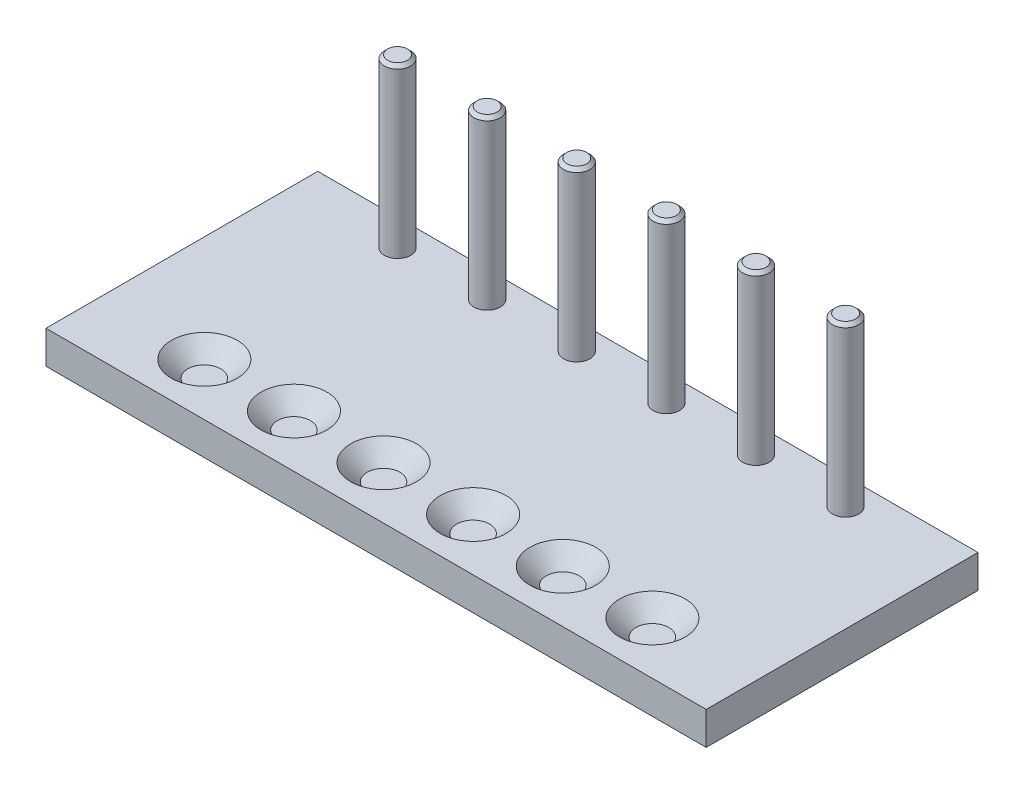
ISO-10303-21;
HEADER;
FILE_DESCRIPTION(('STEP AP214'),'2;1');
FILE_NAME('part.step','',(''),(''),'','','');
FILE_SCHEMA(('AUTOMOTIVE_DESIGN { 1 0 10303 214 1 1 1 1 }'));
ENDSEC;
DATA;
#1=APPLICATION_CONTEXT('core data for automotive mechanical design processes');
#2=APPLICATION_PROTOCOL_DEFINITION('international standard','automotive_design',2000,#1);
#3=PRODUCT_CONTEXT('',#1,'mechanical');
#4=PRODUCT('Part','Part','',(#3));
#5=PRODUCT_RELATED_PRODUCT_CATEGORY('part','',(#4));
#6=PRODUCT_DEFINITION_FORMATION('','',#4);
#7=PRODUCT_DEFINITION_CONTEXT('part definition',#1,'design');
#8=PRODUCT_DEFINITION('design','',#6,#7);
#9=PRODUCT_DEFINITION_SHAPE('','',#8);
#10=(LENGTH_UNIT() NAMED_UNIT(*) SI_UNIT(.MILLI.,.METRE.));
#11=(NAMED_UNIT(*) PLANE_ANGLE_UNIT() SI_UNIT($,.RADIAN.));
#12=(NAMED_UNIT(*) SI_UNIT($,.STERADIAN.) SOLID_ANGLE_UNIT());
#13=UNCERTAINTY_MEASURE_WITH_UNIT(LENGTH_MEASURE(1.E-05),#10,'distance_accuracy_value','');
#14=(GEOMETRIC_REPRESENTATION_CONTEXT(3) GLOBAL_UNCERTAINTY_ASSIGNED_CONTEXT((#13)) GLOBAL_UNIT_ASSIGNED_CONTEXT((#10,
#11,#12)) REPRESENTATION_CONTEXT('',''));
#15=CARTESIAN_POINT('',(0.,0.,0.));
#16=DIRECTION('',(0.,0.,1.));
#17=DIRECTION('',(1.,0.,0.));
#18=AXIS2_PLACEMENT_3D('',#15,#16,#17);
#19=CARTESIAN_POINT('',(-75.9860815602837,0.,44.0221631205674));
#20=DIRECTION('',(0.,1.,0.));
#21=DIRECTION('',(0.,0.,1.));
#22=AXIS2_PLACEMENT_3D('',#19,#20,#21);
#23=PLANE('',#22);
#24=CARTESIAN_POINT('',(-48.7718815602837,0.,28.1471631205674));
#25=DIRECTION('',(0.,1.,0.));
#26=DIRECTION('',(0.,0.,1.));
#27=AXIS2_PLACEMENT_3D('',#24,#25,#26);
#28=CIRCLE('',#27,10.);
#29=CARTESIAN_POINT('',(-48.7718815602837,0.,38.1471631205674));
#30=VERTEX_POINT('',#29);
#31=EDGE_CURVE('E160',#30,#30,#28,.F.);
#32=ORIENTED_EDGE('',*,*,#31,.T.);
#33=EDGE_LOOP('',(#32));
#34=FACE_BOUND('',#33,.T.);
#35=CARTESIAN_POINT('',(-21.5576815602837,0.,28.1471631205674));
#36=DIRECTION('',(0.,1.,0.));
#37=DIRECTION('',(0.,0.,1.));
#38=AXIS2_PLACEMENT_3D('',#35,#36,#37);
#39=CIRCLE('',#38,10.);
#40=CARTESIAN_POINT('',(-21.5576815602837,0.,38.1471631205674));
#41=VERTEX_POINT('',#40);
#42=EDGE_CURVE('E157',#41,#41,#39,.F.);
#43=ORIENTED_EDGE('',*,*,#42,.T.);
#44=EDGE_LOOP('',(#43));
#45=FACE_BOUND('',#44,.T.);
#46=CARTESIAN_POINT('',(5.65651843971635,0.,28.1471631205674));
#47=DIRECTION('',(0.,1.,0.));
#48=DIRECTION('',(0.,0.,1.));
#49=AXIS2_PLACEMENT_3D('',#46,#47,#48);
#50=CIRCLE('',#49,10.);
#51=CARTESIAN_POINT('',(5.65651843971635,0.,38.1471631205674));
#52=VERTEX_POINT('',#51);
#53=EDGE_CURVE('E154',#52,#52,#50,.F.);
#54=ORIENTED_EDGE('',*,*,#53,.T.);
#55=EDGE_LOOP('',(#54));
#56=FACE_BOUND('',#55,.T.);
#57=CARTESIAN_POINT('',(87.2997184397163,0.,28.1471631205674));
#58=DIRECTION('',(0.,1.,0.));
#59=DIRECTION('',(0.,0.,1.));
#60=AXIS2_PLACEMENT_3D('',#57,#58,#59);
#61=CIRCLE('',#60,10.);
#62=CARTESIAN_POINT('',(87.2997184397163,0.,38.1471631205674));
#63=VERTEX_POINT('',#62);
#64=EDGE_CURVE('E151',#63,#63,#61,.F.);
#65=ORIENTED_EDGE('',*,*,#64,.T.);
#66=EDGE_LOOP('',(#65));
#67=FACE_BOUND('',#66,.T.);
#68=CARTESIAN_POINT('',(60.0855184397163,0.,28.1471631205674));
#69=DIRECTION('',(0.,1.,0.));
#70=DIRECTION('',(0.,0.,1.));
#71=AXIS2_PLACEMENT_3D('',#68,#69,#70);
#72=CIRCLE('',#71,10.);
#73=CARTESIAN_POINT('',(60.0855184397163,0.,38.1471631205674));
#74=VERTEX_POINT('',#73);
#75=EDGE_CURVE('E148',#74,#74,#72,.F.);
#76=ORIENTED_EDGE('',*,*,#75,.T.);
#77=EDGE_LOOP('',(#76));
#78=FACE_BOUND('',#77,.T.);
#79=CARTESIAN_POINT('',(32.8713184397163,0.,28.1471631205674));
#80=DIRECTION('',(0.,1.,0.));
#81=DIRECTION('',(0.,0.,1.));
#82=AXIS2_PLACEMENT_3D('',#79,#80,#81);
#83=CIRCLE('',#82,10.);
#84=CARTESIAN_POINT('',(32.8713184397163,0.,38.1471631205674));
#85=VERTEX_POINT('',#84);
#86=EDGE_CURVE('E144',#85,#85,#83,.F.);
#87=ORIENTED_EDGE('',*,*,#86,.T.);
#88=EDGE_LOOP('',(#87));
#89=FACE_BOUND('',#88,.T.);
#90=CARTESIAN_POINT('',(60.0855184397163,0.,-30.5278368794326));
#91=DIRECTION('',(0.,1.,0.));
#92=DIRECTION('',(0.,0.,1.));
#93=AXIS2_PLACEMENT_3D('',#90,#91,#92);
#94=CIRCLE('',#93,4.00000000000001);
#95=CARTESIAN_POINT('',(60.0855184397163,0.,-26.5278368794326));
#96=VERTEX_POINT('',#95);
#97=EDGE_CURVE('E109',#96,#96,#94,.T.);
#98=ORIENTED_EDGE('',*,*,#97,.F.);
#99=EDGE_LOOP('',(#98));
#100=FACE_BOUND('',#99,.T.);
#101=CARTESIAN_POINT('',(5.65711843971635,0.,-30.5278368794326));
#102=DIRECTION('',(0.,1.,0.));
#103=DIRECTION('',(0.,0.,1.));
#104=AXIS2_PLACEMENT_3D('',#101,#102,#103);
#105=CIRCLE('',#104,4.);
#106=CARTESIAN_POINT('',(5.65711843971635,0.,-26.5278368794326));
#107=VERTEX_POINT('',#106);
#108=EDGE_CURVE('E115',#107,#107,#105,.T.);
#109=ORIENTED_EDGE('',*,*,#108,.F.);
#110=EDGE_LOOP('',(#109));
#111=FACE_BOUND('',#110,.T.);
#112=CARTESIAN_POINT('',(-48.7718815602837,0.,-30.5278368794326));
#113=DIRECTION('',(0.,1.,0.));
#114=DIRECTION('',(0.,0.,1.));
#115=AXIS2_PLACEMENT_3D('',#112,#113,#114);
#116=CIRCLE('',#115,4.00000000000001);
#117=CARTESIAN_POINT('',(-48.7718815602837,0.,-26.5278368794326));
#118=VERTEX_POINT('',#117);
#119=EDGE_CURVE('E121',#118,#118,#116,.T.);
#120=ORIENTED_EDGE('',*,*,#119,.F.);
#121=EDGE_LOOP('',(#120));
#122=FACE_BOUND('',#121,.T.);
#123=DIRECTION('',(-1.,0.,0.));
#124=VECTOR('',#123,1.);
#125=CARTESIAN_POINT('',(-75.9860815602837,0.,-38.5278368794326));
#126=LINE('',#125,#124);
#127=CARTESIAN_POINT('',(119.513918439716,0.,-38.5278368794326));
#128=VERTEX_POINT('',#127);
#129=CARTESIAN_POINT('',(-80.9860815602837,0.,-38.5278368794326));
#130=VERTEX_POINT('',#129);
#131=EDGE_CURVE('E60',#128,#130,#126,.T.);
#132=ORIENTED_EDGE('',*,*,#131,.T.);
#133=DIRECTION('',(0.,0.,1.));
#134=VECTOR('',#133,1.);
#135=CARTESIAN_POINT('',(-80.9860815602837,0.,-38.5278368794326));
#136=LINE('',#135,#134);
#137=CARTESIAN_POINT('',(-80.9860815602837,0.,44.0221631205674));
#138=VERTEX_POINT('',#137);
#139=EDGE_CURVE('E89',#130,#138,#136,.T.);
#140=ORIENTED_EDGE('',*,*,#139,.T.);
#141=DIRECTION('',(1.,0.,0.));
#142=VECTOR('',#141,1.);
#143=CARTESIAN_POINT('',(-75.9860815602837,0.,44.0221631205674));
#144=LINE('',#143,#142);
#145=CARTESIAN_POINT('',(119.513918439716,0.,44.0221631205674));
#146=VERTEX_POINT('',#145);
#147=EDGE_CURVE('E81',#138,#146,#144,.T.);
#148=ORIENTED_EDGE('',*,*,#147,.T.);
#149=DIRECTION('',(0.,0.,-1.));
#150=VECTOR('',#149,1.);
#151=CARTESIAN_POINT('',(119.513918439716,0.,-38.5278368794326));
#152=LINE('',#151,#150);
#153=EDGE_CURVE('E87',#146,#128,#152,.T.);
#154=ORIENTED_EDGE('',*,*,#153,.T.);
#155=EDGE_LOOP('',(#132,#140,#148,#154));
#156=FACE_BOUND('',#155,.T.);
#157=CARTESIAN_POINT('',(-21.5576815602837,0.,-30.5278368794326));
#158=DIRECTION('',(0.,1.,0.));
#159=DIRECTION('',(0.,0.,1.));
#160=AXIS2_PLACEMENT_3D('',#157,#158,#159);
#161=CIRCLE('',#160,4.);
#162=CARTESIAN_POINT('',(-21.5576815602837,0.,-26.5278368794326));
#163=VERTEX_POINT('',#162);
#164=EDGE_CURVE('E118',#163,#163,#161,.T.);
#165=ORIENTED_EDGE('',*,*,#164,.F.);
#166=EDGE_LOOP('',(#165));
#167=FACE_BOUND('',#166,.T.);
#168=CARTESIAN_POINT('',(32.8713184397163,0.,-30.5278368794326));
#169=DIRECTION('',(0.,1.,0.));
#170=DIRECTION('',(0.,0.,1.));
#171=AXIS2_PLACEMENT_3D('',#168,#169,#170);
#172=CIRCLE('',#171,4.00000000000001);
#173=CARTESIAN_POINT('',(32.8713184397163,0.,-26.5278368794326));
#174=VERTEX_POINT('',#173);
#175=EDGE_CURVE('E112',#174,#174,#172,.T.);
#176=ORIENTED_EDGE('',*,*,#175,.F.);
#177=EDGE_LOOP('',(#176));
#178=FACE_BOUND('',#177,.T.);
#179=CARTESIAN_POINT('',(87.2997184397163,0.,-30.5278368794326));
#180=DIRECTION('',(0.,1.,0.));
#181=DIRECTION('',(0.,0.,1.));
#182=AXIS2_PLACEMENT_3D('',#179,#180,#181);
#183=CIRCLE('',#182,4.00000000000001);
#184=CARTESIAN_POINT('',(87.2997184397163,0.,-26.5278368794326));
#185=VERTEX_POINT('',#184);
#186=EDGE_CURVE('E105',#185,#185,#183,.T.);
#187=ORIENTED_EDGE('',*,*,#186,.F.);
#188=EDGE_LOOP('',(#187));
#189=FACE_BOUND('',#188,.T.);
#190=ADVANCED_FACE('F31',(#34,#45,#56,#67,#78,#89,#100,#111,#122,#156,#167,#178,#189),#23,.T.);
#191=CARTESIAN_POINT('',(-75.9860815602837,-10.,-38.5278368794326));
#192=DIRECTION('',(0.,0.,-1.));
#193=DIRECTION('',(-1.,0.,0.));
#194=AXIS2_PLACEMENT_3D('',#191,#192,#193);
#195=PLANE('',#194);
#196=ORIENTED_EDGE('',*,*,#131,.F.);
#197=DIRECTION('',(0.,1.,0.));
#198=VECTOR('',#197,1.);
#199=CARTESIAN_POINT('',(119.513918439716,-10.,-38.5278368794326));
#200=LINE('',#199,#198);
#201=CARTESIAN_POINT('',(119.513918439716,-10.,-38.5278368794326));
#202=VERTEX_POINT('',#201);
#203=EDGE_CURVE('E76',#202,#128,#200,.T.);
#204=ORIENTED_EDGE('',*,*,#203,.F.);
#205=DIRECTION('',(-1.,0.,0.));
#206=VECTOR('',#205,1.);
#207=CARTESIAN_POINT('',(-75.9860815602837,-10.,-38.5278368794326));
#208=LINE('',#207,#206);
#209=CARTESIAN_POINT('',(-80.9860815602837,-10.,-38.5278368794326));
#210=VERTEX_POINT('',#209);
#211=EDGE_CURVE('E66',#202,#210,#208,.T.);
#212=ORIENTED_EDGE('',*,*,#211,.T.);
#213=DIRECTION('',(0.,1.,0.));
#214=VECTOR('',#213,1.);
#215=CARTESIAN_POINT('',(-80.9860815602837,-10.,-38.5278368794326));
#216=LINE('',#215,#214);
#217=EDGE_CURVE('E79',#210,#130,#216,.T.);
#218=ORIENTED_EDGE('',*,*,#217,.T.);
#219=EDGE_LOOP('',(#196,#204,#212,#218));
#220=FACE_BOUND('',#219,.T.);
#221=ADVANCED_FACE('F75',(#220),#195,.T.);
#222=CARTESIAN_POINT('',(-75.9860815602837,-10.,44.0221631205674));
#223=DIRECTION('',(0.,0.,1.));
#224=DIRECTION('',(1.,0.,0.));
#225=AXIS2_PLACEMENT_3D('',#222,#223,#224);
#226=PLANE('',#225);
#227=ORIENTED_EDGE('',*,*,#147,.F.);
#228=DIRECTION('',(0.,1.,0.));
#229=VECTOR('',#228,1.);
#230=CARTESIAN_POINT('',(-80.9860815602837,-10.,44.0221631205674));
#231=LINE('',#230,#229);
#232=CARTESIAN_POINT('',(-80.9860815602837,-10.,44.0221631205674));
#233=VERTEX_POINT('',#232);
#234=EDGE_CURVE('E102',#233,#138,#231,.T.);
#235=ORIENTED_EDGE('',*,*,#234,.F.);
#236=DIRECTION('',(1.,0.,0.));
#237=VECTOR('',#236,1.);
#238=CARTESIAN_POINT('',(-75.9860815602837,-10.,44.0221631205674));
#239=LINE('',#238,#237);
#240=CARTESIAN_POINT('',(119.513918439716,-10.,44.0221631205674));
#241=VERTEX_POINT('',#240);
#242=EDGE_CURVE('E48',#233,#241,#239,.T.);
#243=ORIENTED_EDGE('',*,*,#242,.T.);
#244=DIRECTION('',(0.,1.,0.));
#245=VECTOR('',#244,1.);
#246=CARTESIAN_POINT('',(119.513918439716,-10.,44.0221631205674));
#247=LINE('',#246,#245);
#248=EDGE_CURVE('E90',#241,#146,#247,.T.);
#249=ORIENTED_EDGE('',*,*,#248,.T.);
#250=EDGE_LOOP('',(#227,#235,#243,#249));
#251=FACE_BOUND('',#250,.T.);
#252=ADVANCED_FACE('F216',(#251),#226,.T.);
#253=CARTESIAN_POINT('',(-75.9860815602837,-10.,44.0221631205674));
#254=DIRECTION('',(0.,1.,0.));
#255=DIRECTION('',(0.,0.,1.));
#256=AXIS2_PLACEMENT_3D('',#253,#254,#255);
#257=PLANE('',#256);
#258=ORIENTED_EDGE('',*,*,#242,.F.);
#259=DIRECTION('',(0.,0.,1.));
#260=VECTOR('',#259,1.);
#261=CARTESIAN_POINT('',(-80.9860815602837,-10.,-38.5278368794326));
#262=LINE('',#261,#260);
#263=EDGE_CURVE('E98',#210,#233,#262,.T.);
#264=ORIENTED_EDGE('',*,*,#263,.F.);
#265=ORIENTED_EDGE('',*,*,#211,.F.);
#266=DIRECTION('',(0.,0.,-1.));
#267=VECTOR('',#266,1.);
#268=CARTESIAN_POINT('',(119.513918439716,-10.,-38.5278368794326));
#269=LINE('',#268,#267);
#270=EDGE_CURVE('E88',#241,#202,#269,.T.);
#271=ORIENTED_EDGE('',*,*,#270,.F.);
#272=EDGE_LOOP('',(#258,#264,#265,#271));
#273=FACE_BOUND('',#272,.T.);
#274=ADVANCED_FACE('F220',(#273),#257,.F.);
#275=CARTESIAN_POINT('',(87.2997184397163,-5.,28.1471631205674));
#276=DIRECTION('',(0.,1.,0.));
#277=DIRECTION('',(0.,0.,1.));
#278=AXIS2_PLACEMENT_3D('',#275,#276,#277);
#279=PLANE('',#278);
#280=CARTESIAN_POINT('',(87.2997184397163,-5.,28.1471631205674));
#281=DIRECTION('',(0.,1.,0.));
#282=DIRECTION('',(0.,0.,1.));
#283=AXIS2_PLACEMENT_3D('',#280,#281,#282);
#284=CIRCLE('',#283,5.);
#285=CARTESIAN_POINT('',(87.2997184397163,-5.,33.1471631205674));
#286=VERTEX_POINT('',#285);
#287=EDGE_CURVE('E139',#286,#286,#284,.T.);
#288=ORIENTED_EDGE('',*,*,#287,.T.);
#289=EDGE_LOOP('',(#288));
#290=FACE_BOUND('',#289,.T.);
#291=ADVANCED_FACE('F319',(#290),#279,.T.);
#292=CARTESIAN_POINT('',(60.0855184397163,-5.,28.1471631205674));
#293=DIRECTION('',(0.,1.,0.));
#294=DIRECTION('',(0.,0.,1.));
#295=AXIS2_PLACEMENT_3D('',#292,#293,#294);
#296=PLANE('',#295);
#297=CARTESIAN_POINT('',(60.0855184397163,-5.,28.1471631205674));
#298=DIRECTION('',(0.,1.,0.));
#299=DIRECTION('',(0.,0.,1.));
#300=AXIS2_PLACEMENT_3D('',#297,#298,#299);
#301=CIRCLE('',#300,5.);
#302=CARTESIAN_POINT('',(60.0855184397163,-5.,33.1471631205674));
#303=VERTEX_POINT('',#302);
#304=EDGE_CURVE('E136',#303,#303,#301,.T.);
#305=ORIENTED_EDGE('',*,*,#304,.T.);
#306=EDGE_LOOP('',(#305));
#307=FACE_BOUND('',#306,.T.);
#308=ADVANCED_FACE('F316',(#307),#296,.T.);
#309=CARTESIAN_POINT('',(32.8713184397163,-5.,28.1471631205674));
#310=DIRECTION('',(0.,1.,0.));
#311=DIRECTION('',(0.,0.,1.));
#312=AXIS2_PLACEMENT_3D('',#309,#310,#311);
#313=PLANE('',#312);
#314=CARTESIAN_POINT('',(32.8713184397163,-5.,28.1471631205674));
#315=DIRECTION('',(0.,1.,0.));
#316=DIRECTION('',(0.,0.,1.));
#317=AXIS2_PLACEMENT_3D('',#314,#315,#316);
#318=CIRCLE('',#317,5.);
#319=CARTESIAN_POINT('',(32.8713184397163,-5.,33.1471631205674));
#320=VERTEX_POINT('',#319);
#321=EDGE_CURVE('E133',#320,#320,#318,.T.);
#322=ORIENTED_EDGE('',*,*,#321,.T.);
#323=EDGE_LOOP('',(#322));
#324=FACE_BOUND('',#323,.T.);
#325=ADVANCED_FACE('F312',(#324),#313,.T.);
#326=CARTESIAN_POINT('',(5.65651843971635,-5.,28.1471631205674));
#327=DIRECTION('',(0.,1.,0.));
#328=DIRECTION('',(0.,0.,1.));
#329=AXIS2_PLACEMENT_3D('',#326,#327,#328);
#330=PLANE('',#329);
#331=CARTESIAN_POINT('',(5.65651843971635,-5.,28.1471631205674));
#332=DIRECTION('',(0.,1.,0.));
#333=DIRECTION('',(0.,0.,1.));
#334=AXIS2_PLACEMENT_3D('',#331,#332,#333);
#335=CIRCLE('',#334,5.);
#336=CARTESIAN_POINT('',(5.65651843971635,-5.,33.1471631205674));
#337=VERTEX_POINT('',#336);
#338=EDGE_CURVE('E130',#337,#337,#335,.T.);
#339=ORIENTED_EDGE('',*,*,#338,.T.);
#340=EDGE_LOOP('',(#339));
#341=FACE_BOUND('',#340,.T.);
#342=ADVANCED_FACE('F308',(#341),#330,.T.);
#343=CARTESIAN_POINT('',(-21.5576815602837,-5.,28.1471631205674));
#344=DIRECTION('',(0.,1.,0.));
#345=DIRECTION('',(0.,0.,1.));
#346=AXIS2_PLACEMENT_3D('',#343,#344,#345);
#347=PLANE('',#346);
#348=CARTESIAN_POINT('',(-21.5576815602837,-5.,28.1471631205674));
#349=DIRECTION('',(0.,1.,0.));
#350=DIRECTION('',(0.,0.,1.));
#351=AXIS2_PLACEMENT_3D('',#348,#349,#350);
#352=CIRCLE('',#351,5.);
#353=CARTESIAN_POINT('',(-21.5576815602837,-5.,33.1471631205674));
#354=VERTEX_POINT('',#353);
#355=EDGE_CURVE('E127',#354,#354,#352,.T.);
#356=ORIENTED_EDGE('',*,*,#355,.T.);
#357=EDGE_LOOP('',(#356));
#358=FACE_BOUND('',#357,.T.);
#359=ADVANCED_FACE('F304',(#358),#347,.T.);
#360=CARTESIAN_POINT('',(-48.7718815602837,-5.,28.1471631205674));
#361=DIRECTION('',(0.,1.,0.));
#362=DIRECTION('',(0.,0.,1.));
#363=AXIS2_PLACEMENT_3D('',#360,#361,#362);
#364=PLANE('',#363);
#365=CARTESIAN_POINT('',(-48.7718815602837,-5.,28.1471631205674));
#366=DIRECTION('',(0.,1.,0.));
#367=DIRECTION('',(0.,0.,1.));
#368=AXIS2_PLACEMENT_3D('',#365,#366,#367);
#369=CIRCLE('',#368,5.);
#370=CARTESIAN_POINT('',(-48.7718815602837,-5.,33.1471631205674));
#371=VERTEX_POINT('',#370);
#372=EDGE_CURVE('E124',#371,#371,#369,.T.);
#373=ORIENTED_EDGE('',*,*,#372,.T.);
#374=EDGE_LOOP('',(#373));
#375=FACE_BOUND('',#374,.T.);
#376=ADVANCED_FACE('F300',(#375),#364,.T.);
#377=CARTESIAN_POINT('',(-48.7718815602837,50.8,-30.5278368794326));
#378=DIRECTION('',(0.,-1.,0.));
#379=DIRECTION('',(0.,0.,-1.));
#380=AXIS2_PLACEMENT_3D('',#377,#378,#379);
#381=CYLINDRICAL_SURFACE('',#380,4.00000000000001);
#382=CARTESIAN_POINT('',(-48.7718815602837,49.8,-30.5278368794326));
#383=DIRECTION('',(0.,1.,0.));
#384=DIRECTION('',(0.,0.,1.));
#385=AXIS2_PLACEMENT_3D('',#382,#383,#384);
#386=CIRCLE('',#385,4.00000000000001);
#387=CARTESIAN_POINT('',(-48.7718815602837,49.8,-26.5278368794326));
#388=VERTEX_POINT('',#387);
#389=EDGE_CURVE('E11',#388,#388,#386,.F.);
#390=ORIENTED_EDGE('',*,*,#389,.T.);
#391=EDGE_LOOP('',(#390));
#392=FACE_BOUND('',#391,.T.);
#393=ORIENTED_EDGE('',*,*,#119,.T.);
#394=EDGE_LOOP('',(#393));
#395=FACE_BOUND('',#394,.T.);
#396=ADVANCED_FACE('F297',(#392,#395),#381,.T.);
#397=CARTESIAN_POINT('',(-48.7718815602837,50.8,-30.5278368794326));
#398=DIRECTION('',(0.,1.,0.));
#399=DIRECTION('',(0.,0.,1.));
#400=AXIS2_PLACEMENT_3D('',#397,#398,#399);
#401=PLANE('',#400);
#402=CARTESIAN_POINT('',(-48.7718815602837,50.8,-30.5278368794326));
#403=DIRECTION('',(0.,1.,0.));
#404=DIRECTION('',(0.,0.,1.));
#405=AXIS2_PLACEMENT_3D('',#402,#403,#404);
#406=CIRCLE('',#405,3.00000000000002);
#407=CARTESIAN_POINT('',(-48.7718815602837,50.8,-27.5278368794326));
#408=VERTEX_POINT('',#407);
#409=EDGE_CURVE('E40',#408,#408,#406,.T.);
#410=ORIENTED_EDGE('',*,*,#409,.T.);
#411=EDGE_LOOP('',(#410));
#412=FACE_BOUND('',#411,.T.);
#413=ADVANCED_FACE('F195',(#412),#401,.T.);
#414=CARTESIAN_POINT('',(-21.5576815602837,50.8,-30.5278368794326));
#415=DIRECTION('',(0.,-1.,0.));
#416=DIRECTION('',(0.,0.,-1.));
#417=AXIS2_PLACEMENT_3D('',#414,#415,#416);
#418=CYLINDRICAL_SURFACE('',#417,4.);
#419=CARTESIAN_POINT('',(-21.5576815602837,49.8,-30.5278368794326));
#420=DIRECTION('',(0.,1.,0.));
#421=DIRECTION('',(0.,0.,1.));
#422=AXIS2_PLACEMENT_3D('',#419,#420,#421);
#423=CIRCLE('',#422,4.);
#424=CARTESIAN_POINT('',(-21.5576815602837,49.8,-26.5278368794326));
#425=VERTEX_POINT('',#424);
#426=EDGE_CURVE('E190',#425,#425,#423,.F.);
#427=ORIENTED_EDGE('',*,*,#426,.T.);
#428=EDGE_LOOP('',(#427));
#429=FACE_BOUND('',#428,.T.);
#430=ORIENTED_EDGE('',*,*,#164,.T.);
#431=EDGE_LOOP('',(#430));
#432=FACE_BOUND('',#431,.T.);
#433=ADVANCED_FACE('F290',(#429,#432),#418,.T.);
#434=CARTESIAN_POINT('',(-21.5576815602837,50.8,-30.5278368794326));
#435=DIRECTION('',(0.,1.,0.));
#436=DIRECTION('',(0.,0.,1.));
#437=AXIS2_PLACEMENT_3D('',#434,#435,#436);
#438=PLANE('',#437);
#439=CARTESIAN_POINT('',(-21.5576815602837,50.8,-30.5278368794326));
#440=DIRECTION('',(0.,1.,0.));
#441=DIRECTION('',(0.,0.,1.));
#442=AXIS2_PLACEMENT_3D('',#439,#440,#441);
#443=CIRCLE('',#442,3.00000000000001);
#444=CARTESIAN_POINT('',(-21.5576815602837,50.8,-27.5278368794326));
#445=VERTEX_POINT('',#444);
#446=EDGE_CURVE('E187',#445,#445,#443,.T.);
#447=ORIENTED_EDGE('',*,*,#446,.T.);
#448=EDGE_LOOP('',(#447));
#449=FACE_BOUND('',#448,.T.);
#450=ADVANCED_FACE('F283',(#449),#438,.T.);
#451=CARTESIAN_POINT('',(5.65711843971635,50.8,-30.5278368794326));
#452=DIRECTION('',(0.,-1.,0.));
#453=DIRECTION('',(0.,0.,-1.));
#454=AXIS2_PLACEMENT_3D('',#451,#452,#453);
#455=CYLINDRICAL_SURFACE('',#454,4.);
#456=CARTESIAN_POINT('',(5.65711843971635,49.8,-30.5278368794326));
#457=DIRECTION('',(0.,1.,0.));
#458=DIRECTION('',(0.,0.,1.));
#459=AXIS2_PLACEMENT_3D('',#456,#457,#458);
#460=CIRCLE('',#459,4.);
#461=CARTESIAN_POINT('',(5.65711843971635,49.8,-26.5278368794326));
#462=VERTEX_POINT('',#461);
#463=EDGE_CURVE('E184',#462,#462,#460,.F.);
#464=ORIENTED_EDGE('',*,*,#463,.T.);
#465=EDGE_LOOP('',(#464));
#466=FACE_BOUND('',#465,.T.);
#467=ORIENTED_EDGE('',*,*,#108,.T.);
#468=EDGE_LOOP('',(#467));
#469=FACE_BOUND('',#468,.T.);
#470=ADVANCED_FACE('F274',(#466,#469),#455,.T.);
#471=CARTESIAN_POINT('',(5.65711843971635,50.8,-30.5278368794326));
#472=DIRECTION('',(0.,1.,0.));
#473=DIRECTION('',(0.,0.,1.));
#474=AXIS2_PLACEMENT_3D('',#471,#472,#473);
#475=PLANE('',#474);
#476=CARTESIAN_POINT('',(5.65711843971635,50.8,-30.5278368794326));
#477=DIRECTION('',(0.,1.,0.));
#478=DIRECTION('',(0.,0.,1.));
#479=AXIS2_PLACEMENT_3D('',#476,#477,#478);
#480=CIRCLE('',#479,3.00000000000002);
#481=CARTESIAN_POINT('',(5.65711843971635,50.8,-27.5278368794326));
#482=VERTEX_POINT('',#481);
#483=EDGE_CURVE('E181',#482,#482,#480,.T.);
#484=ORIENTED_EDGE('',*,*,#483,.T.);
#485=EDGE_LOOP('',(#484));
#486=FACE_BOUND('',#485,.T.);
#487=ADVANCED_FACE('F271',(#486),#475,.T.);
#488=CARTESIAN_POINT('',(32.8713184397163,50.8,-30.5278368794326));
#489=DIRECTION('',(0.,-1.,0.));
#490=DIRECTION('',(0.,0.,-1.));
#491=AXIS2_PLACEMENT_3D('',#488,#489,#490);
#492=CYLINDRICAL_SURFACE('',#491,4.00000000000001);
#493=CARTESIAN_POINT('',(32.8713184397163,49.8,-30.5278368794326));
#494=DIRECTION('',(0.,1.,0.));
#495=DIRECTION('',(0.,0.,1.));
#496=AXIS2_PLACEMENT_3D('',#493,#494,#495);
#497=CIRCLE('',#496,4.00000000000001);
#498=CARTESIAN_POINT('',(32.8713184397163,49.8,-26.5278368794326));
#499=VERTEX_POINT('',#498);
#500=EDGE_CURVE('E178',#499,#499,#497,.F.);
#501=ORIENTED_EDGE('',*,*,#500,.T.);
#502=EDGE_LOOP('',(#501));
#503=FACE_BOUND('',#502,.T.);
#504=ORIENTED_EDGE('',*,*,#175,.T.);
#505=EDGE_LOOP('',(#504));
#506=FACE_BOUND('',#505,.T.);
#507=ADVANCED_FACE('F273',(#503,#506),#492,.T.);
#508=CARTESIAN_POINT('',(32.8713184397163,50.8,-30.5278368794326));
#509=DIRECTION('',(0.,1.,0.));
#510=DIRECTION('',(0.,0.,1.));
#511=AXIS2_PLACEMENT_3D('',#508,#509,#510);
#512=PLANE('',#511);
#513=CARTESIAN_POINT('',(32.8713184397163,50.8,-30.5278368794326));
#514=DIRECTION('',(0.,1.,0.));
#515=DIRECTION('',(0.,0.,1.));
#516=AXIS2_PLACEMENT_3D('',#513,#514,#515);
#517=CIRCLE('',#516,3.00000000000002);
#518=CARTESIAN_POINT('',(32.8713184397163,50.8,-27.5278368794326));
#519=VERTEX_POINT('',#518);
#520=EDGE_CURVE('E175',#519,#519,#517,.T.);
#521=ORIENTED_EDGE('',*,*,#520,.T.);
#522=EDGE_LOOP('',(#521));
#523=FACE_BOUND('',#522,.T.);
#524=ADVANCED_FACE('F280',(#523),#512,.T.);
#525=CARTESIAN_POINT('',(60.0855184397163,50.8,-30.5278368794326));
#526=DIRECTION('',(0.,-1.,0.));
#527=DIRECTION('',(0.,0.,-1.));
#528=AXIS2_PLACEMENT_3D('',#525,#526,#527);
#529=CYLINDRICAL_SURFACE('',#528,4.00000000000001);
#530=CARTESIAN_POINT('',(60.0855184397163,49.8,-30.5278368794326));
#531=DIRECTION('',(0.,1.,0.));
#532=DIRECTION('',(0.,0.,1.));
#533=AXIS2_PLACEMENT_3D('',#530,#531,#532);
#534=CIRCLE('',#533,4.00000000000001);
#535=CARTESIAN_POINT('',(60.0855184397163,49.8,-26.5278368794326));
#536=VERTEX_POINT('',#535);
#537=EDGE_CURVE('E172',#536,#536,#534,.F.);
#538=ORIENTED_EDGE('',*,*,#537,.T.);
#539=EDGE_LOOP('',(#538));
#540=FACE_BOUND('',#539,.T.);
#541=ORIENTED_EDGE('',*,*,#97,.T.);
#542=EDGE_LOOP('',(#541));
#543=FACE_BOUND('',#542,.T.);
#544=ADVANCED_FACE('F409',(#540,#543),#529,.T.);
#545=CARTESIAN_POINT('',(60.0855184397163,50.8,-30.5278368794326));
#546=DIRECTION('',(0.,1.,0.));
#547=DIRECTION('',(0.,0.,1.));
#548=AXIS2_PLACEMENT_3D('',#545,#546,#547);
#549=PLANE('',#548);
#550=CARTESIAN_POINT('',(60.0855184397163,50.8,-30.5278368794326));
#551=DIRECTION('',(0.,1.,0.));
#552=DIRECTION('',(0.,0.,1.));
#553=AXIS2_PLACEMENT_3D('',#550,#551,#552);
#554=CIRCLE('',#553,3.00000000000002);
#555=CARTESIAN_POINT('',(60.0855184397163,50.8,-27.5278368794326));
#556=VERTEX_POINT('',#555);
#557=EDGE_CURVE('E169',#556,#556,#554,.T.);
#558=ORIENTED_EDGE('',*,*,#557,.T.);
#559=EDGE_LOOP('',(#558));
#560=FACE_BOUND('',#559,.T.);
#561=ADVANCED_FACE('F399',(#560),#549,.T.);
#562=CARTESIAN_POINT('',(87.2997184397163,50.8,-30.5278368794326));
#563=DIRECTION('',(0.,-1.,0.));
#564=DIRECTION('',(0.,0.,-1.));
#565=AXIS2_PLACEMENT_3D('',#562,#563,#564);
#566=CYLINDRICAL_SURFACE('',#565,4.00000000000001);
#567=CARTESIAN_POINT('',(87.2997184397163,49.8,-30.5278368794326));
#568=DIRECTION('',(0.,1.,0.));
#569=DIRECTION('',(0.,0.,1.));
#570=AXIS2_PLACEMENT_3D('',#567,#568,#569);
#571=CIRCLE('',#570,4.00000000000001);
#572=CARTESIAN_POINT('',(87.2997184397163,49.8,-26.5278368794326));
#573=VERTEX_POINT('',#572);
#574=EDGE_CURVE('E166',#573,#573,#571,.F.);
#575=ORIENTED_EDGE('',*,*,#574,.T.);
#576=EDGE_LOOP('',(#575));
#577=FACE_BOUND('',#576,.T.);
#578=ORIENTED_EDGE('',*,*,#186,.T.);
#579=EDGE_LOOP('',(#578));
#580=FACE_BOUND('',#579,.T.);
#581=ADVANCED_FACE('F388',(#577,#580),#566,.T.);
#582=CARTESIAN_POINT('',(87.2997184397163,50.8,-30.5278368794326));
#583=DIRECTION('',(0.,1.,0.));
#584=DIRECTION('',(0.,0.,1.));
#585=AXIS2_PLACEMENT_3D('',#582,#583,#584);
#586=PLANE('',#585);
#587=CARTESIAN_POINT('',(87.2997184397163,50.8,-30.5278368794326));
#588=DIRECTION('',(0.,1.,0.));
#589=DIRECTION('',(0.,0.,1.));
#590=AXIS2_PLACEMENT_3D('',#587,#588,#589);
#591=CIRCLE('',#590,3.00000000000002);
#592=CARTESIAN_POINT('',(87.2997184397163,50.8,-27.5278368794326));
#593=VERTEX_POINT('',#592);
#594=EDGE_CURVE('E163',#593,#593,#591,.T.);
#595=ORIENTED_EDGE('',*,*,#594,.T.);
#596=EDGE_LOOP('',(#595));
#597=FACE_BOUND('',#596,.T.);
#598=ADVANCED_FACE('F230',(#597),#586,.T.);
#599=CARTESIAN_POINT('',(-48.7718815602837,-4.99999999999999,28.1471631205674));
#600=DIRECTION('',(0.,1.,0.));
#601=DIRECTION('',(0.,0.,1.));
#602=AXIS2_PLACEMENT_3D('',#599,#600,#601);
#603=CONICAL_SURFACE('',#602,5.,0.785398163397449);
#604=CARTESIAN_POINT('',(-48.7718815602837,0.,38.1471631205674));
#605=CARTESIAN_POINT('',(-48.7718815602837,-0.0520833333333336,38.095079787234));
#606=CARTESIAN_POINT('',(-48.7718815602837,-0.104166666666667,38.0429964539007));
#607=CARTESIAN_POINT('',(-48.7718815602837,-0.208333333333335,37.938829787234));
#608=CARTESIAN_POINT('',(-48.7718815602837,-0.260416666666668,37.8867464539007));
#609=CARTESIAN_POINT('',(-48.7718815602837,-0.364583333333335,37.782579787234));
#610=CARTESIAN_POINT('',(-48.7718815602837,-0.416666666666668,37.7304964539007));
#611=CARTESIAN_POINT('',(-48.7718815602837,-0.520833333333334,37.626329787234));
#612=CARTESIAN_POINT('',(-48.7718815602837,-0.572916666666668,37.5742464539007));
#613=CARTESIAN_POINT('',(-48.7718815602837,-0.677083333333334,37.470079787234));
#614=CARTESIAN_POINT('',(-48.7718815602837,-0.729166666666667,37.4179964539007));
#615=CARTESIAN_POINT('',(-48.7718815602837,-0.833333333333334,37.313829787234));
#616=CARTESIAN_POINT('',(-48.7718815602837,-0.885416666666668,37.2617464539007));
#617=CARTESIAN_POINT('',(-48.7718815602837,-0.989583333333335,37.157579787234));
#618=CARTESIAN_POINT('',(-48.7718815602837,-1.04166666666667,37.1054964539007));
#619=CARTESIAN_POINT('',(-48.7718815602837,-1.14583333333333,37.001329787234));
#620=CARTESIAN_POINT('',(-48.7718815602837,-1.19791666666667,36.9492464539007));
#621=CARTESIAN_POINT('',(-48.7718815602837,-1.30208333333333,36.845079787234));
#622=CARTESIAN_POINT('',(-48.7718815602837,-1.35416666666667,36.7929964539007));
#623=CARTESIAN_POINT('',(-48.7718815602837,-1.45833333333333,36.688829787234));
#624=CARTESIAN_POINT('',(-48.7718815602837,-1.51041666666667,36.6367464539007));
#625=CARTESIAN_POINT('',(-48.7718815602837,-1.61458333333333,36.532579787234));
#626=CARTESIAN_POINT('',(-48.7718815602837,-1.66666666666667,36.4804964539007));
#627=CARTESIAN_POINT('',(-48.7718815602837,-1.77083333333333,36.376329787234));
#628=CARTESIAN_POINT('',(-48.7718815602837,-1.82291666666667,36.3242464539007));
#629=CARTESIAN_POINT('',(-48.7718815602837,-1.92708333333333,36.220079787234));
#630=CARTESIAN_POINT('',(-48.7718815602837,-1.97916666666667,36.1679964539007));
#631=CARTESIAN_POINT('',(-48.7718815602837,-2.08333333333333,36.063829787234));
#632=CARTESIAN_POINT('',(-48.7718815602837,-2.13541666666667,36.0117464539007));
#633=CARTESIAN_POINT('',(-48.7718815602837,-2.23958333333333,35.907579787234));
#634=CARTESIAN_POINT('',(-48.7718815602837,-2.29166666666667,35.8554964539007));
#635=CARTESIAN_POINT('',(-48.7718815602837,-2.39583333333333,35.751329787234));
#636=CARTESIAN_POINT('',(-48.7718815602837,-2.44791666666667,35.6992464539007));
#637=CARTESIAN_POINT('',(-48.7718815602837,-2.55208333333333,35.595079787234));
#638=CARTESIAN_POINT('',(-48.7718815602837,-2.60416666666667,35.5429964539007));
#639=CARTESIAN_POINT('',(-48.7718815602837,-2.70833333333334,35.438829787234));
#640=CARTESIAN_POINT('',(-48.7718815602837,-2.76041666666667,35.3867464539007));
#641=CARTESIAN_POINT('',(-48.7718815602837,-2.86458333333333,35.282579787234));
#642=CARTESIAN_POINT('',(-48.7718815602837,-2.91666666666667,35.2304964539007));
#643=CARTESIAN_POINT('',(-48.7718815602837,-3.02083333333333,35.126329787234));
#644=CARTESIAN_POINT('',(-48.7718815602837,-3.07291666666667,35.0742464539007));
#645=CARTESIAN_POINT('',(-48.7718815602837,-3.17708333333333,34.970079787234));
#646=CARTESIAN_POINT('',(-48.7718815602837,-3.22916666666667,34.9179964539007));
#647=CARTESIAN_POINT('',(-48.7718815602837,-3.33333333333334,34.813829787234));
#648=CARTESIAN_POINT('',(-48.7718815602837,-3.38541666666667,34.7617464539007));
#649=CARTESIAN_POINT('',(-48.7718815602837,-3.48958333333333,34.657579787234));
#650=CARTESIAN_POINT('',(-48.7718815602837,-3.54166666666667,34.6054964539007));
#651=CARTESIAN_POINT('',(-48.7718815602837,-3.64583333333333,34.501329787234));
#652=CARTESIAN_POINT('',(-48.7718815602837,-3.69791666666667,34.4492464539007));
#653=CARTESIAN_POINT('',(-48.7718815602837,-3.80208333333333,34.345079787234));
#654=CARTESIAN_POINT('',(-48.7718815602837,-3.85416666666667,34.2929964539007));
#655=CARTESIAN_POINT('',(-48.7718815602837,-3.95833333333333,34.188829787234));
#656=CARTESIAN_POINT('',(-48.7718815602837,-4.01041666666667,34.1367464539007));
#657=CARTESIAN_POINT('',(-48.7718815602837,-4.11458333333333,34.032579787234));
#658=CARTESIAN_POINT('',(-48.7718815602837,-4.16666666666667,33.9804964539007));
#659=CARTESIAN_POINT('',(-48.7718815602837,-4.27083333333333,33.876329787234));
#660=CARTESIAN_POINT('',(-48.7718815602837,-4.32291666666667,33.8242464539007));
#661=CARTESIAN_POINT('',(-48.7718815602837,-4.42708333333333,33.720079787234));
#662=CARTESIAN_POINT('',(-48.7718815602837,-4.47916666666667,33.6679964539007));
#663=CARTESIAN_POINT('',(-48.7718815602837,-4.58333333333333,33.563829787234));
#664=CARTESIAN_POINT('',(-48.7718815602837,-4.63541666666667,33.5117464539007));
#665=CARTESIAN_POINT('',(-48.7718815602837,-4.73958333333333,33.407579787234));
#666=CARTESIAN_POINT('',(-48.7718815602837,-4.79166666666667,33.3554964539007));
#667=CARTESIAN_POINT('',(-48.7718815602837,-4.89583333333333,33.251329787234));
#668=CARTESIAN_POINT('',(-48.7718815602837,-4.94791666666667,33.1992464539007));
#669=CARTESIAN_POINT('',(-48.7718815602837,-5.,33.1471631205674));
#670=B_SPLINE_CURVE_WITH_KNOTS('',3,(#604,#605,#606,#607,#608,#609,#610,#611,#612,#613,#614,
#615,#616,#617,#618,#619,#620,#621,#622,#623,#624,#625,#626,#627,#628,#629,#630,#631,#632,#633,
#634,#635,#636,#637,#638,#639,#640,#641,#642,#643,#644,#645,#646,#647,#648,#649,#650,#651,#652,
#653,#654,#655,#656,#657,#658,#659,#660,#661,#662,#663,#664,#665,#666,#667,#668,#669),
.UNSPECIFIED.,.F.,.F.,(4,2,2,2,2,2,2,2,2,2,2,2,2,2,2,2,2,2,2,2,2,2,2,2,2,2,2,2,2,2,2,2,4),(0.,
0.220970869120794,0.441941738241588,0.662912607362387,0.883883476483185,1.10485434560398,
1.32582521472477,1.54679608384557,1.76776695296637,1.98873782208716,2.20970869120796,
2.43067956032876,2.65165042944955,2.87262129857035,3.09359216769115,3.31456303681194,
3.53553390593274,3.75650477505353,3.97747564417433,4.19844651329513,4.41941738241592,
4.64038825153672,4.86135912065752,5.08232998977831,5.30330085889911,5.5242717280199,
5.7452425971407,5.9662134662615,6.18718433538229,6.40815520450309,6.62912607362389,
6.85009694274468,7.07106781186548),.UNSPECIFIED.);
#671=EDGE_CURVE('BSEAM226',#30,#371,#670,.T.);
#672=ORIENTED_EDGE('',*,*,#31,.F.);
#673=ORIENTED_EDGE('',*,*,#372,.F.);
#674=ORIENTED_EDGE('',*,*,#671,.T.);
#675=ORIENTED_EDGE('',*,*,#671,.F.);
#676=EDGE_LOOP('',(#672,#674,#673,#675));
#677=FACE_BOUND('',#676,.T.);
#678=ADVANCED_FACE('F226',(#677),#603,.F.);
#679=CARTESIAN_POINT('',(-21.5576815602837,-5.,28.1471631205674));
#680=DIRECTION('',(0.,1.,0.));
#681=DIRECTION('',(0.,0.,1.));
#682=AXIS2_PLACEMENT_3D('',#679,#680,#681);
#683=CONICAL_SURFACE('',#682,5.,0.785398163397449);
#684=ORIENTED_EDGE('',*,*,#42,.F.);
#685=EDGE_LOOP('',(#684));
#686=FACE_BOUND('',#685,.T.);
#687=ORIENTED_EDGE('',*,*,#355,.F.);
#688=EDGE_LOOP('',(#687));
#689=FACE_BOUND('',#688,.T.);
#690=ADVANCED_FACE('F229',(#686,#689),#683,.F.);
#691=CARTESIAN_POINT('',(5.65651843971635,-4.99999999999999,28.1471631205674));
#692=DIRECTION('',(0.,1.,0.));
#693=DIRECTION('',(0.,0.,1.));
#694=AXIS2_PLACEMENT_3D('',#691,#692,#693);
#695=CONICAL_SURFACE('',#694,5.,0.785398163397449);
#696=CARTESIAN_POINT('',(5.65651843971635,0.,38.1471631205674));
#697=CARTESIAN_POINT('',(5.65651843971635,-0.0520833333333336,38.095079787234));
#698=CARTESIAN_POINT('',(5.65651843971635,-0.104166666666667,38.0429964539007));
#699=CARTESIAN_POINT('',(5.65651843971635,-0.208333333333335,37.938829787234));
#700=CARTESIAN_POINT('',(5.65651843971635,-0.260416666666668,37.8867464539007));
#701=CARTESIAN_POINT('',(5.65651843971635,-0.364583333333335,37.782579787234));
#702=CARTESIAN_POINT('',(5.65651843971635,-0.416666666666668,37.7304964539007));
#703=CARTESIAN_POINT('',(5.65651843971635,-0.520833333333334,37.626329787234));
#704=CARTESIAN_POINT('',(5.65651843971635,-0.572916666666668,37.5742464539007));
#705=CARTESIAN_POINT('',(5.65651843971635,-0.677083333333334,37.470079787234));
#706=CARTESIAN_POINT('',(5.65651843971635,-0.729166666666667,37.4179964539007));
#707=CARTESIAN_POINT('',(5.65651843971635,-0.833333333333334,37.313829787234));
#708=CARTESIAN_POINT('',(5.65651843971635,-0.885416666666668,37.2617464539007));
#709=CARTESIAN_POINT('',(5.65651843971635,-0.989583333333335,37.157579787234));
#710=CARTESIAN_POINT('',(5.65651843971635,-1.04166666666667,37.1054964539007));
#711=CARTESIAN_POINT('',(5.65651843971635,-1.14583333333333,37.001329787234));
#712=CARTESIAN_POINT('',(5.65651843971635,-1.19791666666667,36.9492464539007));
#713=CARTESIAN_POINT('',(5.65651843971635,-1.30208333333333,36.845079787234));
#714=CARTESIAN_POINT('',(5.65651843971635,-1.35416666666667,36.7929964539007));
#715=CARTESIAN_POINT('',(5.65651843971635,-1.45833333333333,36.688829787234));
#716=CARTESIAN_POINT('',(5.65651843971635,-1.51041666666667,36.6367464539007));
#717=CARTESIAN_POINT('',(5.65651843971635,-1.61458333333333,36.532579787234));
#718=CARTESIAN_POINT('',(5.65651843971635,-1.66666666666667,36.4804964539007));
#719=CARTESIAN_POINT('',(5.65651843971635,-1.77083333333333,36.376329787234));
#720=CARTESIAN_POINT('',(5.65651843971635,-1.82291666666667,36.3242464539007));
#721=CARTESIAN_POINT('',(5.65651843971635,-1.92708333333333,36.220079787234));
#722=CARTESIAN_POINT('',(5.65651843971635,-1.97916666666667,36.1679964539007));
#723=CARTESIAN_POINT('',(5.65651843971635,-2.08333333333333,36.063829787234));
#724=CARTESIAN_POINT('',(5.65651843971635,-2.13541666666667,36.0117464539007));
#725=CARTESIAN_POINT('',(5.65651843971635,-2.23958333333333,35.907579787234));
#726=CARTESIAN_POINT('',(5.65651843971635,-2.29166666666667,35.8554964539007));
#727=CARTESIAN_POINT('',(5.65651843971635,-2.39583333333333,35.751329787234));
#728=CARTESIAN_POINT('',(5.65651843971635,-2.44791666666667,35.6992464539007));
#729=CARTESIAN_POINT('',(5.65651843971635,-2.55208333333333,35.595079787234));
#730=CARTESIAN_POINT('',(5.65651843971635,-2.60416666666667,35.5429964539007));
#731=CARTESIAN_POINT('',(5.65651843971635,-2.70833333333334,35.438829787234));
#732=CARTESIAN_POINT('',(5.65651843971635,-2.76041666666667,35.3867464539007));
#733=CARTESIAN_POINT('',(5.65651843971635,-2.86458333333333,35.282579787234));
#734=CARTESIAN_POINT('',(5.65651843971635,-2.91666666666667,35.2304964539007));
#735=CARTESIAN_POINT('',(5.65651843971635,-3.02083333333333,35.126329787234));
#736=CARTESIAN_POINT('',(5.65651843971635,-3.07291666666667,35.0742464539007));
#737=CARTESIAN_POINT('',(5.65651843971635,-3.17708333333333,34.970079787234));
#738=CARTESIAN_POINT('',(5.65651843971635,-3.22916666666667,34.9179964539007));
#739=CARTESIAN_POINT('',(5.65651843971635,-3.33333333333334,34.813829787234));
#740=CARTESIAN_POINT('',(5.65651843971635,-3.38541666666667,34.7617464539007));
#741=CARTESIAN_POINT('',(5.65651843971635,-3.48958333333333,34.657579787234));
#742=CARTESIAN_POINT('',(5.65651843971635,-3.54166666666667,34.6054964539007));
#743=CARTESIAN_POINT('',(5.65651843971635,-3.64583333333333,34.501329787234));
#744=CARTESIAN_POINT('',(5.65651843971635,-3.69791666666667,34.4492464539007));
#745=CARTESIAN_POINT('',(5.65651843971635,-3.80208333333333,34.345079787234));
#746=CARTESIAN_POINT('',(5.65651843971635,-3.85416666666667,34.2929964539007));
#747=CARTESIAN_POINT('',(5.65651843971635,-3.95833333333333,34.188829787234));
#748=CARTESIAN_POINT('',(5.65651843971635,-4.01041666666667,34.1367464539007));
#749=CARTESIAN_POINT('',(5.65651843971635,-4.11458333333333,34.032579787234));
#750=CARTESIAN_POINT('',(5.65651843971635,-4.16666666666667,33.9804964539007));
#751=CARTESIAN_POINT('',(5.65651843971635,-4.27083333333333,33.876329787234));
#752=CARTESIAN_POINT('',(5.65651843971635,-4.32291666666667,33.8242464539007));
#753=CARTESIAN_POINT('',(5.65651843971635,-4.42708333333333,33.720079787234));
#754=CARTESIAN_POINT('',(5.65651843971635,-4.47916666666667,33.6679964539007));
#755=CARTESIAN_POINT('',(5.65651843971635,-4.58333333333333,33.563829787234));
#756=CARTESIAN_POINT('',(5.65651843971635,-4.63541666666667,33.5117464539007));
#757=CARTESIAN_POINT('',(5.65651843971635,-4.73958333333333,33.407579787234));
#758=CARTESIAN_POINT('',(5.65651843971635,-4.79166666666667,33.3554964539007));
#759=CARTESIAN_POINT('',(5.65651843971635,-4.89583333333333,33.251329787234));
#760=CARTESIAN_POINT('',(5.65651843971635,-4.94791666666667,33.1992464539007));
#761=CARTESIAN_POINT('',(5.65651843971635,-5.,33.1471631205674));
#762=B_SPLINE_CURVE_WITH_KNOTS('',3,(#696,#697,#698,#699,#700,#701,#702,#703,#704,#705,#706,
#707,#708,#709,#710,#711,#712,#713,#714,#715,#716,#717,#718,#719,#720,#721,#722,#723,#724,#725,
#726,#727,#728,#729,#730,#731,#732,#733,#734,#735,#736,#737,#738,#739,#740,#741,#742,#743,#744,
#745,#746,#747,#748,#749,#750,#751,#752,#753,#754,#755,#756,#757,#758,#759,#760,#761),
.UNSPECIFIED.,.F.,.F.,(4,2,2,2,2,2,2,2,2,2,2,2,2,2,2,2,2,2,2,2,2,2,2,2,2,2,2,2,2,2,2,2,4),(0.,
0.220970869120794,0.441941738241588,0.662912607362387,0.883883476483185,1.10485434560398,
1.32582521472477,1.54679608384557,1.76776695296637,1.98873782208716,2.20970869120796,
2.43067956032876,2.65165042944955,2.87262129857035,3.09359216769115,3.31456303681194,
3.53553390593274,3.75650477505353,3.97747564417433,4.19844651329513,4.41941738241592,
4.64038825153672,4.86135912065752,5.08232998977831,5.30330085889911,5.5242717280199,
5.7452425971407,5.9662134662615,6.18718433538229,6.40815520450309,6.62912607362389,
6.85009694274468,7.07106781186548),.UNSPECIFIED.);
#763=EDGE_CURVE('BSEAM234',#52,#337,#762,.T.);
#764=ORIENTED_EDGE('',*,*,#53,.F.);
#765=ORIENTED_EDGE('',*,*,#338,.F.);
#766=ORIENTED_EDGE('',*,*,#763,.T.);
#767=ORIENTED_EDGE('',*,*,#763,.F.);
#768=EDGE_LOOP('',(#764,#766,#765,#767));
#769=FACE_BOUND('',#768,.T.);
#770=ADVANCED_FACE('F234',(#769),#695,.F.);
#771=CARTESIAN_POINT('',(87.2997184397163,-4.99999999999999,28.1471631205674));
#772=DIRECTION('',(0.,1.,0.));
#773=DIRECTION('',(0.,0.,1.));
#774=AXIS2_PLACEMENT_3D('',#771,#772,#773);
#775=CONICAL_SURFACE('',#774,5.,0.785398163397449);
#776=CARTESIAN_POINT('',(87.2997184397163,0.,38.1471631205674));
#777=CARTESIAN_POINT('',(87.2997184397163,-0.0520833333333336,38.095079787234));
#778=CARTESIAN_POINT('',(87.2997184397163,-0.104166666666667,38.0429964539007));
#779=CARTESIAN_POINT('',(87.2997184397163,-0.208333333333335,37.938829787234));
#780=CARTESIAN_POINT('',(87.2997184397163,-0.260416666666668,37.8867464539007));
#781=CARTESIAN_POINT('',(87.2997184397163,-0.364583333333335,37.782579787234));
#782=CARTESIAN_POINT('',(87.2997184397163,-0.416666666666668,37.7304964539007));
#783=CARTESIAN_POINT('',(87.2997184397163,-0.520833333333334,37.626329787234));
#784=CARTESIAN_POINT('',(87.2997184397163,-0.572916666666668,37.5742464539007));
#785=CARTESIAN_POINT('',(87.2997184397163,-0.677083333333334,37.470079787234));
#786=CARTESIAN_POINT('',(87.2997184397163,-0.729166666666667,37.4179964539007));
#787=CARTESIAN_POINT('',(87.2997184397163,-0.833333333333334,37.313829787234));
#788=CARTESIAN_POINT('',(87.2997184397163,-0.885416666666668,37.2617464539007));
#789=CARTESIAN_POINT('',(87.2997184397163,-0.989583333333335,37.157579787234));
#790=CARTESIAN_POINT('',(87.2997184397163,-1.04166666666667,37.1054964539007));
#791=CARTESIAN_POINT('',(87.2997184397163,-1.14583333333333,37.001329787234));
#792=CARTESIAN_POINT('',(87.2997184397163,-1.19791666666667,36.9492464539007));
#793=CARTESIAN_POINT('',(87.2997184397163,-1.30208333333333,36.845079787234));
#794=CARTESIAN_POINT('',(87.2997184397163,-1.35416666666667,36.7929964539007));
#795=CARTESIAN_POINT('',(87.2997184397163,-1.45833333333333,36.688829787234));
#796=CARTESIAN_POINT('',(87.2997184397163,-1.51041666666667,36.6367464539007));
#797=CARTESIAN_POINT('',(87.2997184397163,-1.61458333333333,36.532579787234));
#798=CARTESIAN_POINT('',(87.2997184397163,-1.66666666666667,36.4804964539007));
#799=CARTESIAN_POINT('',(87.2997184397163,-1.77083333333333,36.376329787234));
#800=CARTESIAN_POINT('',(87.2997184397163,-1.82291666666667,36.3242464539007));
#801=CARTESIAN_POINT('',(87.2997184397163,-1.92708333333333,36.220079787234));
#802=CARTESIAN_POINT('',(87.2997184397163,-1.97916666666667,36.1679964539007));
#803=CARTESIAN_POINT('',(87.2997184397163,-2.08333333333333,36.063829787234));
#804=CARTESIAN_POINT('',(87.2997184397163,-2.13541666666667,36.0117464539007));
#805=CARTESIAN_POINT('',(87.2997184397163,-2.23958333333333,35.907579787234));
#806=CARTESIAN_POINT('',(87.2997184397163,-2.29166666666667,35.8554964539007));
#807=CARTESIAN_POINT('',(87.2997184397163,-2.39583333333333,35.751329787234));
#808=CARTESIAN_POINT('',(87.2997184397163,-2.44791666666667,35.6992464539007));
#809=CARTESIAN_POINT('',(87.2997184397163,-2.55208333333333,35.595079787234));
#810=CARTESIAN_POINT('',(87.2997184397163,-2.60416666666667,35.5429964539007));
#811=CARTESIAN_POINT('',(87.2997184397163,-2.70833333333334,35.438829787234));
#812=CARTESIAN_POINT('',(87.2997184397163,-2.76041666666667,35.3867464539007));
#813=CARTESIAN_POINT('',(87.2997184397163,-2.86458333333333,35.282579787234));
#814=CARTESIAN_POINT('',(87.2997184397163,-2.91666666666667,35.2304964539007));
#815=CARTESIAN_POINT('',(87.2997184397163,-3.02083333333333,35.126329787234));
#816=CARTESIAN_POINT('',(87.2997184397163,-3.07291666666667,35.0742464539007));
#817=CARTESIAN_POINT('',(87.2997184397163,-3.17708333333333,34.970079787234));
#818=CARTESIAN_POINT('',(87.2997184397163,-3.22916666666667,34.9179964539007));
#819=CARTESIAN_POINT('',(87.2997184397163,-3.33333333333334,34.813829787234));
#820=CARTESIAN_POINT('',(87.2997184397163,-3.38541666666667,34.7617464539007));
#821=CARTESIAN_POINT('',(87.2997184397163,-3.48958333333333,34.657579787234));
#822=CARTESIAN_POINT('',(87.2997184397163,-3.54166666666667,34.6054964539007));
#823=CARTESIAN_POINT('',(87.2997184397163,-3.64583333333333,34.501329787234));
#824=CARTESIAN_POINT('',(87.2997184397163,-3.69791666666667,34.4492464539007));
#825=CARTESIAN_POINT('',(87.2997184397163,-3.80208333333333,34.345079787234));
#826=CARTESIAN_POINT('',(87.2997184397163,-3.85416666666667,34.2929964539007));
#827=CARTESIAN_POINT('',(87.2997184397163,-3.95833333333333,34.188829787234));
#828=CARTESIAN_POINT('',(87.2997184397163,-4.01041666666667,34.1367464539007));
#829=CARTESIAN_POINT('',(87.2997184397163,-4.11458333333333,34.032579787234));
#830=CARTESIAN_POINT('',(87.2997184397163,-4.16666666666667,33.9804964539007));
#831=CARTESIAN_POINT('',(87.2997184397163,-4.27083333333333,33.876329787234));
#832=CARTESIAN_POINT('',(87.2997184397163,-4.32291666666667,33.8242464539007));
#833=CARTESIAN_POINT('',(87.2997184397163,-4.42708333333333,33.720079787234));
#834=CARTESIAN_POINT('',(87.2997184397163,-4.47916666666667,33.6679964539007));
#835=CARTESIAN_POINT('',(87.2997184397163,-4.58333333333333,33.563829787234));
#836=CARTESIAN_POINT('',(87.2997184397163,-4.63541666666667,33.5117464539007));
#837=CARTESIAN_POINT('',(87.2997184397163,-4.73958333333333,33.407579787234));
#838=CARTESIAN_POINT('',(87.2997184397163,-4.79166666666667,33.3554964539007));
#839=CARTESIAN_POINT('',(87.2997184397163,-4.89583333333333,33.251329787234));
#840=CARTESIAN_POINT('',(87.2997184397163,-4.94791666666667,33.1992464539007));
#841=CARTESIAN_POINT('',(87.2997184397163,-5.,33.1471631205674));
#842=B_SPLINE_CURVE_WITH_KNOTS('',3,(#776,#777,#778,#779,#780,#781,#782,#783,#784,#785,#786,
#787,#788,#789,#790,#791,#792,#793,#794,#795,#796,#797,#798,#799,#800,#801,#802,#803,#804,#805,
#806,#807,#808,#809,#810,#811,#812,#813,#814,#815,#816,#817,#818,#819,#820,#821,#822,#823,#824,
#825,#826,#827,#828,#829,#830,#831,#832,#833,#834,#835,#836,#837,#838,#839,#840,#841),
.UNSPECIFIED.,.F.,.F.,(4,2,2,2,2,2,2,2,2,2,2,2,2,2,2,2,2,2,2,2,2,2,2,2,2,2,2,2,2,2,2,2,4),(0.,
0.220970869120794,0.441941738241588,0.662912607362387,0.883883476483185,1.10485434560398,
1.32582521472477,1.54679608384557,1.76776695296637,1.98873782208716,2.20970869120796,
2.43067956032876,2.65165042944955,2.87262129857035,3.09359216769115,3.31456303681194,
3.53553390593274,3.75650477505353,3.97747564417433,4.19844651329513,4.41941738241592,
4.64038825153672,4.86135912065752,5.08232998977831,5.30330085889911,5.5242717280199,
5.7452425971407,5.9662134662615,6.18718433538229,6.40815520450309,6.62912607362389,
6.85009694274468,7.07106781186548),.UNSPECIFIED.);
#843=EDGE_CURVE('BSEAM238',#63,#286,#842,.T.);
#844=ORIENTED_EDGE('',*,*,#64,.F.);
#845=ORIENTED_EDGE('',*,*,#287,.F.);
#846=ORIENTED_EDGE('',*,*,#843,.T.);
#847=ORIENTED_EDGE('',*,*,#843,.F.);
#848=EDGE_LOOP('',(#844,#846,#845,#847));
#849=FACE_BOUND('',#848,.T.);
#850=ADVANCED_FACE('F238',(#849),#775,.F.);
#851=CARTESIAN_POINT('',(60.0855184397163,-4.99999999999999,28.1471631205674));
#852=DIRECTION('',(0.,1.,0.));
#853=DIRECTION('',(0.,0.,1.));
#854=AXIS2_PLACEMENT_3D('',#851,#852,#853);
#855=CONICAL_SURFACE('',#854,5.,0.785398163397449);
#856=CARTESIAN_POINT('',(60.0855184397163,0.,38.1471631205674));
#857=CARTESIAN_POINT('',(60.0855184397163,-0.0520833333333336,38.095079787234));
#858=CARTESIAN_POINT('',(60.0855184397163,-0.104166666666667,38.0429964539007));
#859=CARTESIAN_POINT('',(60.0855184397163,-0.208333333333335,37.938829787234));
#860=CARTESIAN_POINT('',(60.0855184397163,-0.260416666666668,37.8867464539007));
#861=CARTESIAN_POINT('',(60.0855184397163,-0.364583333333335,37.782579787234));
#862=CARTESIAN_POINT('',(60.0855184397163,-0.416666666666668,37.7304964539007));
#863=CARTESIAN_POINT('',(60.0855184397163,-0.520833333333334,37.626329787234));
#864=CARTESIAN_POINT('',(60.0855184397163,-0.572916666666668,37.5742464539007));
#865=CARTESIAN_POINT('',(60.0855184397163,-0.677083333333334,37.470079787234));
#866=CARTESIAN_POINT('',(60.0855184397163,-0.729166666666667,37.4179964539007));
#867=CARTESIAN_POINT('',(60.0855184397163,-0.833333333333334,37.313829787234));
#868=CARTESIAN_POINT('',(60.0855184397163,-0.885416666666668,37.2617464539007));
#869=CARTESIAN_POINT('',(60.0855184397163,-0.989583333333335,37.157579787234));
#870=CARTESIAN_POINT('',(60.0855184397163,-1.04166666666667,37.1054964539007));
#871=CARTESIAN_POINT('',(60.0855184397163,-1.14583333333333,37.001329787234));
#872=CARTESIAN_POINT('',(60.0855184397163,-1.19791666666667,36.9492464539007));
#873=CARTESIAN_POINT('',(60.0855184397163,-1.30208333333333,36.845079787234));
#874=CARTESIAN_POINT('',(60.0855184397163,-1.35416666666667,36.7929964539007));
#875=CARTESIAN_POINT('',(60.0855184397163,-1.45833333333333,36.688829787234));
#876=CARTESIAN_POINT('',(60.0855184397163,-1.51041666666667,36.6367464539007));
#877=CARTESIAN_POINT('',(60.0855184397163,-1.61458333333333,36.532579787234));
#878=CARTESIAN_POINT('',(60.0855184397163,-1.66666666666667,36.4804964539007));
#879=CARTESIAN_POINT('',(60.0855184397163,-1.77083333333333,36.376329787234));
#880=CARTESIAN_POINT('',(60.0855184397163,-1.82291666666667,36.3242464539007));
#881=CARTESIAN_POINT('',(60.0855184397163,-1.92708333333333,36.220079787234));
#882=CARTESIAN_POINT('',(60.0855184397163,-1.97916666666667,36.1679964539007));
#883=CARTESIAN_POINT('',(60.0855184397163,-2.08333333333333,36.063829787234));
#884=CARTESIAN_POINT('',(60.0855184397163,-2.13541666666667,36.0117464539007));
#885=CARTESIAN_POINT('',(60.0855184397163,-2.23958333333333,35.907579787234));
#886=CARTESIAN_POINT('',(60.0855184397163,-2.29166666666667,35.8554964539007));
#887=CARTESIAN_POINT('',(60.0855184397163,-2.39583333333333,35.751329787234));
#888=CARTESIAN_POINT('',(60.0855184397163,-2.44791666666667,35.6992464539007));
#889=CARTESIAN_POINT('',(60.0855184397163,-2.55208333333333,35.595079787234));
#890=CARTESIAN_POINT('',(60.0855184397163,-2.60416666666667,35.5429964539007));
#891=CARTESIAN_POINT('',(60.0855184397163,-2.70833333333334,35.438829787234));
#892=CARTESIAN_POINT('',(60.0855184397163,-2.76041666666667,35.3867464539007));
#893=CARTESIAN_POINT('',(60.0855184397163,-2.86458333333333,35.282579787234));
#894=CARTESIAN_POINT('',(60.0855184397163,-2.91666666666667,35.2304964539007));
#895=CARTESIAN_POINT('',(60.0855184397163,-3.02083333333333,35.126329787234));
#896=CARTESIAN_POINT('',(60.0855184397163,-3.07291666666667,35.0742464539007));
#897=CARTESIAN_POINT('',(60.0855184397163,-3.17708333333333,34.970079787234));
#898=CARTESIAN_POINT('',(60.0855184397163,-3.22916666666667,34.9179964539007));
#899=CARTESIAN_POINT('',(60.0855184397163,-3.33333333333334,34.813829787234));
#900=CARTESIAN_POINT('',(60.0855184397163,-3.38541666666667,34.7617464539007));
#901=CARTESIAN_POINT('',(60.0855184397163,-3.48958333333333,34.657579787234));
#902=CARTESIAN_POINT('',(60.0855184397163,-3.54166666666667,34.6054964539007));
#903=CARTESIAN_POINT('',(60.0855184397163,-3.64583333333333,34.501329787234));
#904=CARTESIAN_POINT('',(60.0855184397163,-3.69791666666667,34.4492464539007));
#905=CARTESIAN_POINT('',(60.0855184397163,-3.80208333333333,34.345079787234));
#906=CARTESIAN_POINT('',(60.0855184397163,-3.85416666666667,34.2929964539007));
#907=CARTESIAN_POINT('',(60.0855184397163,-3.95833333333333,34.188829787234));
#908=CARTESIAN_POINT('',(60.0855184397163,-4.01041666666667,34.1367464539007));
#909=CARTESIAN_POINT('',(60.0855184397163,-4.11458333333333,34.032579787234));
#910=CARTESIAN_POINT('',(60.0855184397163,-4.16666666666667,33.9804964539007));
#911=CARTESIAN_POINT('',(60.0855184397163,-4.27083333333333,33.876329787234));
#912=CARTESIAN_POINT('',(60.0855184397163,-4.32291666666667,33.8242464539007));
#913=CARTESIAN_POINT('',(60.0855184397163,-4.42708333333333,33.720079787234));
#914=CARTESIAN_POINT('',(60.0855184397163,-4.47916666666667,33.6679964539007));
#915=CARTESIAN_POINT('',(60.0855184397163,-4.58333333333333,33.563829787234));
#916=CARTESIAN_POINT('',(60.0855184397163,-4.63541666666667,33.5117464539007));
#917=CARTESIAN_POINT('',(60.0855184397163,-4.73958333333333,33.407579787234));
#918=CARTESIAN_POINT('',(60.0855184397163,-4.79166666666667,33.3554964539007));
#919=CARTESIAN_POINT('',(60.0855184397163,-4.89583333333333,33.251329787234));
#920=CARTESIAN_POINT('',(60.0855184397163,-4.94791666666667,33.1992464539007));
#921=CARTESIAN_POINT('',(60.0855184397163,-5.,33.1471631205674));
#922=B_SPLINE_CURVE_WITH_KNOTS('',3,(#856,#857,#858,#859,#860,#861,#862,#863,#864,#865,#866,
#867,#868,#869,#870,#871,#872,#873,#874,#875,#876,#877,#878,#879,#880,#881,#882,#883,#884,#885,
#886,#887,#888,#889,#890,#891,#892,#893,#894,#895,#896,#897,#898,#899,#900,#901,#902,#903,#904,
#905,#906,#907,#908,#909,#910,#911,#912,#913,#914,#915,#916,#917,#918,#919,#920,#921),
.UNSPECIFIED.,.F.,.F.,(4,2,2,2,2,2,2,2,2,2,2,2,2,2,2,2,2,2,2,2,2,2,2,2,2,2,2,2,2,2,2,2,4),(0.,
0.220970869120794,0.441941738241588,0.662912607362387,0.883883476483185,1.10485434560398,
1.32582521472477,1.54679608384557,1.76776695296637,1.98873782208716,2.20970869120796,
2.43067956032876,2.65165042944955,2.87262129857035,3.09359216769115,3.31456303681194,
3.53553390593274,3.75650477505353,3.97747564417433,4.19844651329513,4.41941738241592,
4.64038825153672,4.86135912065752,5.08232998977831,5.30330085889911,5.5242717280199,
5.7452425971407,5.9662134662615,6.18718433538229,6.40815520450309,6.62912607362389,
6.85009694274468,7.07106781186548),.UNSPECIFIED.);
#923=EDGE_CURVE('BSEAM242',#74,#303,#922,.T.);
#924=ORIENTED_EDGE('',*,*,#75,.F.);
#925=ORIENTED_EDGE('',*,*,#304,.F.);
#926=ORIENTED_EDGE('',*,*,#923,.T.);
#927=ORIENTED_EDGE('',*,*,#923,.F.);
#928=EDGE_LOOP('',(#924,#926,#925,#927));
#929=FACE_BOUND('',#928,.T.);
#930=ADVANCED_FACE('F242',(#929),#855,.F.);
#931=CARTESIAN_POINT('',(32.8713184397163,-5.,28.1471631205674));
#932=DIRECTION('',(0.,1.,0.));
#933=DIRECTION('',(0.,0.,1.));
#934=AXIS2_PLACEMENT_3D('',#931,#932,#933);
#935=CONICAL_SURFACE('',#934,5.,0.785398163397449);
#936=ORIENTED_EDGE('',*,*,#86,.F.);
#937=EDGE_LOOP('',(#936));
#938=FACE_BOUND('',#937,.T.);
#939=ORIENTED_EDGE('',*,*,#321,.F.);
#940=EDGE_LOOP('',(#939));
#941=FACE_BOUND('',#940,.T.);
#942=ADVANCED_FACE('F246',(#938,#941),#935,.F.);
#943=CARTESIAN_POINT('',(87.2997184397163,50.8,-30.5278368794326));
#944=DIRECTION('',(0.,-1.,0.));
#945=DIRECTION('',(0.,0.,-1.));
#946=AXIS2_PLACEMENT_3D('',#943,#944,#945);
#947=CONICAL_SURFACE('',#946,3.00000000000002,0.785398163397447);
#948=ORIENTED_EDGE('',*,*,#574,.F.);
#949=EDGE_LOOP('',(#948));
#950=FACE_BOUND('',#949,.T.);
#951=ORIENTED_EDGE('',*,*,#594,.F.);
#952=EDGE_LOOP('',(#951));
#953=FACE_BOUND('',#952,.T.);
#954=ADVANCED_FACE('F250',(#950,#953),#947,.T.);
#955=CARTESIAN_POINT('',(60.0855184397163,50.8,-30.5278368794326));
#956=DIRECTION('',(0.,-1.,0.));
#957=DIRECTION('',(0.,0.,-1.));
#958=AXIS2_PLACEMENT_3D('',#955,#956,#957);
#959=CONICAL_SURFACE('',#958,3.00000000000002,0.78539816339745);
#960=ORIENTED_EDGE('',*,*,#537,.F.);
#961=EDGE_LOOP('',(#960));
#962=FACE_BOUND('',#961,.T.);
#963=ORIENTED_EDGE('',*,*,#557,.F.);
#964=EDGE_LOOP('',(#963));
#965=FACE_BOUND('',#964,.T.);
#966=ADVANCED_FACE('F254',(#962,#965),#959,.T.);
#967=CARTESIAN_POINT('',(32.8713184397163,50.8,-30.5278368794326));
#968=DIRECTION('',(0.,-1.,0.));
#969=DIRECTION('',(0.,0.,-1.));
#970=AXIS2_PLACEMENT_3D('',#967,#968,#969);
#971=CONICAL_SURFACE('',#970,3.00000000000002,0.785398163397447);
#972=ORIENTED_EDGE('',*,*,#500,.F.);
#973=EDGE_LOOP('',(#972));
#974=FACE_BOUND('',#973,.T.);
#975=ORIENTED_EDGE('',*,*,#520,.F.);
#976=EDGE_LOOP('',(#975));
#977=FACE_BOUND('',#976,.T.);
#978=ADVANCED_FACE('F258',(#974,#977),#971,.T.);
#979=CARTESIAN_POINT('',(5.65711843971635,50.8,-30.5278368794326));
#980=DIRECTION('',(0.,-1.,0.));
#981=DIRECTION('',(0.,0.,-1.));
#982=AXIS2_PLACEMENT_3D('',#979,#980,#981);
#983=CONICAL_SURFACE('',#982,3.00000000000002,0.785398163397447);
#984=ORIENTED_EDGE('',*,*,#463,.F.);
#985=EDGE_LOOP('',(#984));
#986=FACE_BOUND('',#985,.T.);
#987=ORIENTED_EDGE('',*,*,#483,.F.);
#988=EDGE_LOOP('',(#987));
#989=FACE_BOUND('',#988,.T.);
#990=ADVANCED_FACE('F207',(#986,#989),#983,.T.);
#991=CARTESIAN_POINT('',(-21.5576815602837,50.8,-30.5278368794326));
#992=DIRECTION('',(0.,-1.,0.));
#993=DIRECTION('',(0.,0.,-1.));
#994=AXIS2_PLACEMENT_3D('',#991,#992,#993);
#995=CONICAL_SURFACE('',#994,3.00000000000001,0.785398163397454);
#996=ORIENTED_EDGE('',*,*,#426,.F.);
#997=EDGE_LOOP('',(#996));
#998=FACE_BOUND('',#997,.T.);
#999=ORIENTED_EDGE('',*,*,#446,.F.);
#1000=EDGE_LOOP('',(#999));
#1001=FACE_BOUND('',#1000,.T.);
#1002=ADVANCED_FACE('F199',(#998,#1001),#995,.T.);
#1003=CARTESIAN_POINT('',(-48.7718815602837,50.8,-30.5278368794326));
#1004=DIRECTION('',(0.,-1.,0.));
#1005=DIRECTION('',(0.,0.,-1.));
#1006=AXIS2_PLACEMENT_3D('',#1003,#1004,#1005);
#1007=CONICAL_SURFACE('',#1006,3.00000000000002,0.785398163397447);
#1008=ORIENTED_EDGE('',*,*,#389,.F.);
#1009=EDGE_LOOP('',(#1008));
#1010=FACE_BOUND('',#1009,.T.);
#1011=ORIENTED_EDGE('',*,*,#409,.F.);
#1012=EDGE_LOOP('',(#1011));
#1013=FACE_BOUND('',#1012,.T.);
#1014=ADVANCED_FACE('F33',(#1010,#1013),#1007,.T.);
#1015=CARTESIAN_POINT('',(-80.9860815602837,-10.,-38.5278368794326));
#1016=DIRECTION('',(-1.,0.,0.));
#1017=DIRECTION('',(0.,0.,1.));
#1018=AXIS2_PLACEMENT_3D('',#1015,#1016,#1017);
#1019=PLANE('',#1018);
#1020=ORIENTED_EDGE('',*,*,#139,.F.);
#1021=ORIENTED_EDGE('',*,*,#217,.F.);
#1022=ORIENTED_EDGE('',*,*,#263,.T.);
#1023=ORIENTED_EDGE('',*,*,#234,.T.);
#1024=EDGE_LOOP('',(#1020,#1021,#1022,#1023));
#1025=FACE_BOUND('',#1024,.T.);
#1026=ADVANCED_FACE('F198',(#1025),#1019,.T.);
#1027=CARTESIAN_POINT('',(119.513918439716,-10.,-38.5278368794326));
#1028=DIRECTION('',(1.,0.,0.));
#1029=DIRECTION('',(0.,0.,-1.));
#1030=AXIS2_PLACEMENT_3D('',#1027,#1028,#1029);
#1031=PLANE('',#1030);
#1032=ORIENTED_EDGE('',*,*,#153,.F.);
#1033=ORIENTED_EDGE('',*,*,#248,.F.);
#1034=ORIENTED_EDGE('',*,*,#270,.T.);
#1035=ORIENTED_EDGE('',*,*,#203,.T.);
#1036=EDGE_LOOP('',(#1032,#1033,#1034,#1035));
#1037=FACE_BOUND('',#1036,.T.);
#1038=ADVANCED_FACE('F85',(#1037),#1031,.T.);
#1039=CLOSED_SHELL('',(#190,#221,#252,#274,#291,#308,#325,#342,#359,#376,#396,#413,#433,#450,
#470,#487,#507,#524,#544,#561,#581,#598,#678,#690,#770,#850,#930,#942,#954,#966,#978,#990,#1002,
#1014,#1026,#1038));
#1040=MANIFOLD_SOLID_BREP('B2',#1039);
#1041=ADVANCED_BREP_SHAPE_REPRESENTATION('',(#18,#1040),#14);
#1042=SHAPE_DEFINITION_REPRESENTATION(#9,#1041);
ENDSEC;
END-ISO-10303-21;
